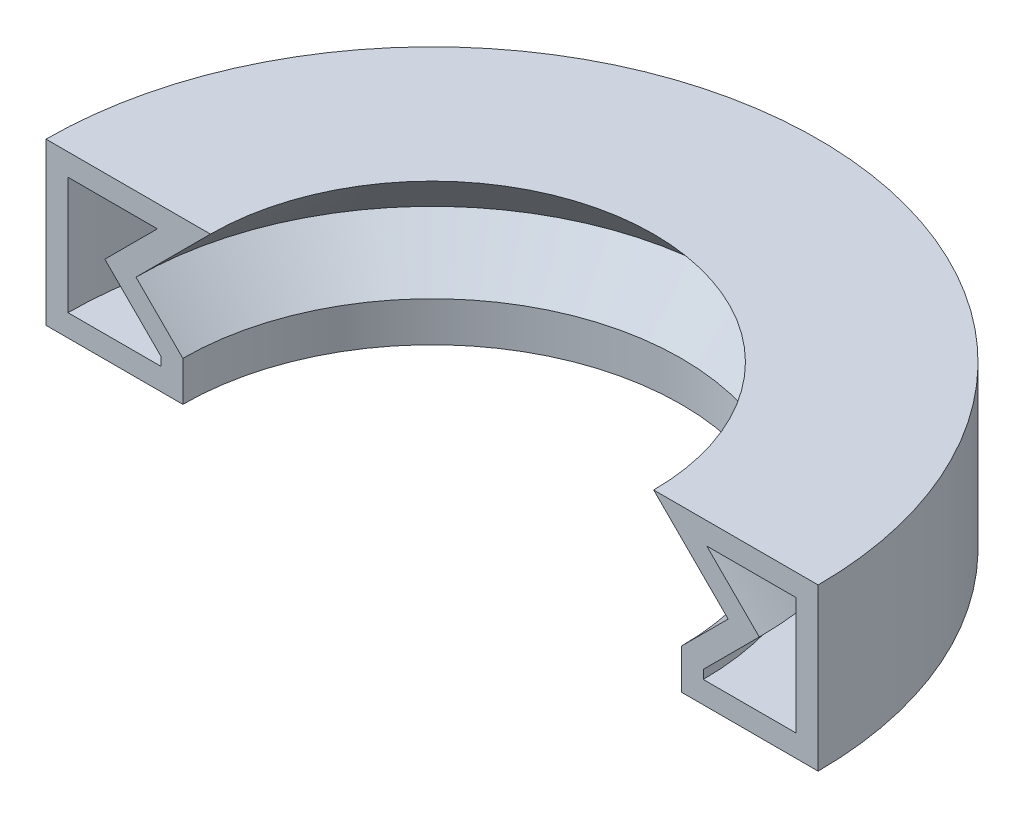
ISO-10303-21;
HEADER;
FILE_DESCRIPTION(('STEP AP214'),'2;1');
FILE_NAME('part.step','',(''),(''),'','','');
FILE_SCHEMA(('AUTOMOTIVE_DESIGN { 1 0 10303 214 1 1 1 1 }'));
ENDSEC;
DATA;
#1=APPLICATION_CONTEXT('core data for automotive mechanical design processes');
#2=APPLICATION_PROTOCOL_DEFINITION('international standard','automotive_design',2000,#1);
#3=PRODUCT_CONTEXT('',#1,'mechanical');
#4=PRODUCT('Part','Part','',(#3));
#5=PRODUCT_RELATED_PRODUCT_CATEGORY('part','',(#4));
#6=PRODUCT_DEFINITION_FORMATION('','',#4);
#7=PRODUCT_DEFINITION_CONTEXT('part definition',#1,'design');
#8=PRODUCT_DEFINITION('design','',#6,#7);
#9=PRODUCT_DEFINITION_SHAPE('','',#8);
#10=(LENGTH_UNIT() NAMED_UNIT(*) SI_UNIT(.MILLI.,.METRE.));
#11=(NAMED_UNIT(*) PLANE_ANGLE_UNIT() SI_UNIT($,.RADIAN.));
#12=(NAMED_UNIT(*) SI_UNIT($,.STERADIAN.) SOLID_ANGLE_UNIT());
#13=UNCERTAINTY_MEASURE_WITH_UNIT(LENGTH_MEASURE(1.E-05),#10,'distance_accuracy_value','');
#14=(GEOMETRIC_REPRESENTATION_CONTEXT(3) GLOBAL_UNCERTAINTY_ASSIGNED_CONTEXT((#13)) GLOBAL_UNIT_ASSIGNED_CONTEXT((#10,
#11,#12)) REPRESENTATION_CONTEXT('',''));
#15=CARTESIAN_POINT('',(0.,0.,0.));
#16=DIRECTION('',(0.,0.,1.));
#17=DIRECTION('',(1.,0.,0.));
#18=AXIS2_PLACEMENT_3D('',#15,#16,#17);
#19=CARTESIAN_POINT('',(-110.,-8.,7.68125894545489E-13));
#20=DIRECTION('',(0.,-1.,0.));
#21=DIRECTION('',(0.,0.,-1.));
#22=AXIS2_PLACEMENT_3D('',#19,#20,#21);
#23=PLANE('',#22);
#24=CARTESIAN_POINT('',(0.,-8.,0.));
#25=DIRECTION('',(0.,-1.,0.));
#26=DIRECTION('',(0.,0.,-1.));
#27=AXIS2_PLACEMENT_3D('',#24,#25,#26);
#28=CIRCLE('',#27,158.);
#29=CARTESIAN_POINT('',(-158.,-8.,1.10330810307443E-12));
#30=VERTEX_POINT('',#29);
#31=CARTESIAN_POINT('',(158.,-8.,0.));
#32=VERTEX_POINT('',#31);
#33=EDGE_CURVE('E11',#30,#32,#28,.T.);
#34=ORIENTED_EDGE('',*,*,#33,.T.);
#35=DIRECTION('',(1.,0.,0.));
#36=VECTOR('',#35,1.);
#37=CARTESIAN_POINT('',(110.,-8.,0.));
#38=LINE('',#37,#36);
#39=CARTESIAN_POINT('',(102.,-8.,0.));
#40=VERTEX_POINT('',#39);
#41=EDGE_CURVE('E128',#40,#32,#38,.T.);
#42=ORIENTED_EDGE('',*,*,#41,.F.);
#43=CARTESIAN_POINT('',(0.,-8.,0.));
#44=DIRECTION('',(0.,-1.,0.));
#45=DIRECTION('',(0.,0.,-1.));
#46=AXIS2_PLACEMENT_3D('',#43,#44,#45);
#47=CIRCLE('',#46,102.);
#48=CARTESIAN_POINT('',(-102.,-8.,7.12262193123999E-13));
#49=VERTEX_POINT('',#48);
#50=EDGE_CURVE('E210',#49,#40,#47,.T.);
#51=ORIENTED_EDGE('',*,*,#50,.F.);
#52=DIRECTION('',(-1.,0.,0.));
#53=VECTOR('',#52,1.);
#54=CARTESIAN_POINT('',(-110.,-8.,7.68125894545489E-13));
#55=LINE('',#54,#53);
#56=EDGE_CURVE('E192',#49,#30,#55,.T.);
#57=ORIENTED_EDGE('',*,*,#56,.T.);
#58=EDGE_LOOP('',(#34,#42,#51,#57));
#59=FACE_BOUND('',#58,.T.);
#60=ADVANCED_FACE('F32',(#59),#23,.T.);
#61=CARTESIAN_POINT('',(0.,0.,0.));
#62=DIRECTION('',(0.,-1.,0.));
#63=DIRECTION('',(0.,0.,-1.));
#64=AXIS2_PLACEMENT_3D('',#61,#62,#63);
#65=CYLINDRICAL_SURFACE('',#64,158.);
#66=CARTESIAN_POINT('',(0.,58.,0.));
#67=DIRECTION('',(0.,-1.,0.));
#68=DIRECTION('',(0.,0.,-1.));
#69=AXIS2_PLACEMENT_3D('',#66,#67,#68);
#70=CIRCLE('',#69,158.);
#71=CARTESIAN_POINT('',(-158.,58.,1.10330810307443E-12));
#72=VERTEX_POINT('',#71);
#73=CARTESIAN_POINT('',(158.,58.,0.));
#74=VERTEX_POINT('',#73);
#75=EDGE_CURVE('E40',#72,#74,#70,.T.);
#76=ORIENTED_EDGE('',*,*,#75,.T.);
#77=DIRECTION('',(0.,1.,0.));
#78=VECTOR('',#77,1.);
#79=CARTESIAN_POINT('',(158.,0.,0.));
#80=LINE('',#79,#78);
#81=EDGE_CURVE('E177',#32,#74,#80,.T.);
#82=ORIENTED_EDGE('',*,*,#81,.F.);
#83=ORIENTED_EDGE('',*,*,#33,.F.);
#84=DIRECTION('',(0.,1.,0.));
#85=VECTOR('',#84,1.);
#86=CARTESIAN_POINT('',(-158.,0.,1.10330810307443E-12));
#87=LINE('',#86,#85);
#88=EDGE_CURVE('E195',#30,#72,#87,.T.);
#89=ORIENTED_EDGE('',*,*,#88,.T.);
#90=EDGE_LOOP('',(#76,#82,#83,#89));
#91=FACE_BOUND('',#90,.T.);
#92=ADVANCED_FACE('F34',(#91),#65,.T.);
#93=CARTESIAN_POINT('',(-150.,58.,1.04744440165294E-12));
#94=DIRECTION('',(0.,1.,0.));
#95=DIRECTION('',(0.,0.,1.));
#96=AXIS2_PLACEMENT_3D('',#93,#94,#95);
#97=PLANE('',#96);
#98=CARTESIAN_POINT('',(0.,58.,0.));
#99=DIRECTION('',(0.,-1.,0.));
#100=DIRECTION('',(0.,0.,-1.));
#101=AXIS2_PLACEMENT_3D('',#98,#99,#100);
#102=CIRCLE('',#101,90.6862915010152);
#103=CARTESIAN_POINT('',(-90.6862915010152,58.,6.33258988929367E-13));
#104=VERTEX_POINT('',#103);
#105=CARTESIAN_POINT('',(90.6862915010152,58.,0.));
#106=VERTEX_POINT('',#105);
#107=EDGE_CURVE('E216',#104,#106,#102,.T.);
#108=ORIENTED_EDGE('',*,*,#107,.T.);
#109=DIRECTION('',(-1.,0.,0.));
#110=VECTOR('',#109,1.);
#111=CARTESIAN_POINT('',(150.,58.,0.));
#112=LINE('',#111,#110);
#113=EDGE_CURVE('E180',#74,#106,#112,.T.);
#114=ORIENTED_EDGE('',*,*,#113,.F.);
#115=ORIENTED_EDGE('',*,*,#75,.F.);
#116=DIRECTION('',(1.,0.,0.));
#117=VECTOR('',#116,1.);
#118=CARTESIAN_POINT('',(-150.,58.,1.04744440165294E-12));
#119=LINE('',#118,#117);
#120=EDGE_CURVE('E198',#72,#104,#119,.T.);
#121=ORIENTED_EDGE('',*,*,#120,.T.);
#122=EDGE_LOOP('',(#108,#114,#115,#121));
#123=FACE_BOUND('',#122,.T.);
#124=ADVANCED_FACE('F225',(#123),#97,.T.);
#125=CARTESIAN_POINT('',(0.,58.,0.));
#126=DIRECTION('',(0.,-1.,0.));
#127=DIRECTION('',(0.,0.,-1.));
#128=AXIS2_PLACEMENT_3D('',#125,#126,#127);
#129=CONICAL_SURFACE('',#128,90.6862915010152,0.785398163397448);
#130=CARTESIAN_POINT('',(0.,27.5,0.));
#131=DIRECTION('',(0.,-1.,0.));
#132=DIRECTION('',(0.,0.,-1.));
#133=AXIS2_PLACEMENT_3D('',#130,#131,#132);
#134=CIRCLE('',#133,121.186291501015);
#135=CARTESIAN_POINT('',(-121.186291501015,27.5,8.46239350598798E-13));
#136=VERTEX_POINT('',#135);
#137=CARTESIAN_POINT('',(121.186291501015,27.5,0.));
#138=VERTEX_POINT('',#137);
#139=EDGE_CURVE('E214',#136,#138,#134,.T.);
#140=ORIENTED_EDGE('',*,*,#139,.T.);
#141=DIRECTION('',(0.707106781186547,-0.707106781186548,0.));
#142=VECTOR('',#141,1.);
#143=CARTESIAN_POINT('',(104.343145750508,44.3431457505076,0.));
#144=LINE('',#143,#142);
#145=EDGE_CURVE('E183',#106,#138,#144,.T.);
#146=ORIENTED_EDGE('',*,*,#145,.F.);
#147=ORIENTED_EDGE('',*,*,#107,.F.);
#148=DIRECTION('',(-0.707106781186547,-0.707106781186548,0.));
#149=VECTOR('',#148,1.);
#150=CARTESIAN_POINT('',(-104.343145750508,44.3431457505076,7.28624292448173E-13));
#151=LINE('',#150,#149);
#152=EDGE_CURVE('E201',#104,#136,#151,.T.);
#153=ORIENTED_EDGE('',*,*,#152,.T.);
#154=EDGE_LOOP('',(#140,#146,#147,#153));
#155=FACE_BOUND('',#154,.T.);
#156=ADVANCED_FACE('F228',(#155),#129,.F.);
#157=CARTESIAN_POINT('',(0.,27.5,0.));
#158=DIRECTION('',(0.,1.,0.));
#159=DIRECTION('',(0.,0.,1.));
#160=AXIS2_PLACEMENT_3D('',#157,#158,#159);
#161=CONICAL_SURFACE('',#160,121.186291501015,0.785398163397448);
#162=CARTESIAN_POINT('',(0.,8.31370849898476,0.));
#163=DIRECTION('',(0.,-1.,0.));
#164=DIRECTION('',(0.,0.,-1.));
#165=AXIS2_PLACEMENT_3D('',#162,#163,#164);
#166=CIRCLE('',#165,102.);
#167=CARTESIAN_POINT('',(-102.,8.31370849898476,7.12262193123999E-13));
#168=VERTEX_POINT('',#167);
#169=CARTESIAN_POINT('',(102.,8.31370849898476,0.));
#170=VERTEX_POINT('',#169);
#171=EDGE_CURVE('E212',#168,#170,#166,.T.);
#172=ORIENTED_EDGE('',*,*,#171,.T.);
#173=DIRECTION('',(-0.707106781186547,-0.707106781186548,0.));
#174=VECTOR('',#173,1.);
#175=CARTESIAN_POINT('',(126.843145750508,33.1568542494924,0.));
#176=LINE('',#175,#174);
#177=EDGE_CURVE('E186',#138,#170,#176,.T.);
#178=ORIENTED_EDGE('',*,*,#177,.F.);
#179=ORIENTED_EDGE('',*,*,#139,.F.);
#180=DIRECTION('',(0.707106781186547,-0.707106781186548,0.));
#181=VECTOR('',#180,1.);
#182=CARTESIAN_POINT('',(-126.843145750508,33.1568542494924,8.85740952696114E-13));
#183=LINE('',#182,#181);
#184=EDGE_CURVE('E204',#136,#168,#183,.T.);
#185=ORIENTED_EDGE('',*,*,#184,.T.);
#186=EDGE_LOOP('',(#172,#178,#179,#185));
#187=FACE_BOUND('',#186,.T.);
#188=ADVANCED_FACE('F233',(#187),#161,.F.);
#189=CARTESIAN_POINT('',(0.,0.,0.));
#190=DIRECTION('',(0.,-1.,0.));
#191=DIRECTION('',(0.,0.,-1.));
#192=AXIS2_PLACEMENT_3D('',#189,#190,#191);
#193=CYLINDRICAL_SURFACE('',#192,102.);
#194=DIRECTION('',(0.,-1.,0.));
#195=VECTOR('',#194,1.);
#196=CARTESIAN_POINT('',(-102.,5.,7.12262193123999E-13));
#197=LINE('',#196,#195);
#198=EDGE_CURVE('E207',#168,#49,#197,.T.);
#199=ORIENTED_EDGE('',*,*,#198,.T.);
#200=ORIENTED_EDGE('',*,*,#50,.T.);
#201=DIRECTION('',(0.,-1.,0.));
#202=VECTOR('',#201,1.);
#203=CARTESIAN_POINT('',(102.,5.,0.));
#204=LINE('',#203,#202);
#205=EDGE_CURVE('E189',#170,#40,#204,.T.);
#206=ORIENTED_EDGE('',*,*,#205,.F.);
#207=ORIENTED_EDGE('',*,*,#171,.F.);
#208=EDGE_LOOP('',(#199,#200,#206,#207));
#209=FACE_BOUND('',#208,.T.);
#210=ADVANCED_FACE('F236',(#209),#193,.F.);
#211=CARTESIAN_POINT('',(0.,0.,0.));
#212=DIRECTION('',(0.,0.,-1.));
#213=DIRECTION('',(-1.,0.,0.));
#214=AXIS2_PLACEMENT_3D('',#211,#212,#213);
#215=PLANE('',#214);
#216=DIRECTION('',(0.,-1.,0.));
#217=VECTOR('',#216,1.);
#218=CARTESIAN_POINT('',(-111.,5.,7.75108857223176E-13));
#219=LINE('',#218,#217);
#220=CARTESIAN_POINT('',(-111.,4.5857864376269,7.75108857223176E-13));
#221=VERTEX_POINT('',#220);
#222=CARTESIAN_POINT('',(-111.,1.,7.75108857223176E-13));
#223=VERTEX_POINT('',#222);
#224=EDGE_CURVE('E164',#221,#223,#219,.T.);
#225=ORIENTED_EDGE('',*,*,#224,.T.);
#226=DIRECTION('',(-1.,0.,0.));
#227=VECTOR('',#226,1.);
#228=CARTESIAN_POINT('',(-110.,1.,7.68125894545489E-13));
#229=LINE('',#228,#227);
#230=CARTESIAN_POINT('',(-149.,1.,1.04046143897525E-12));
#231=VERTEX_POINT('',#230);
#232=EDGE_CURVE('E47',#223,#231,#229,.T.);
#233=ORIENTED_EDGE('',*,*,#232,.T.);
#234=DIRECTION('',(0.,1.,0.));
#235=VECTOR('',#234,1.);
#236=CARTESIAN_POINT('',(-149.,0.,1.04046143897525E-12));
#237=LINE('',#236,#235);
#238=CARTESIAN_POINT('',(-149.,49.,1.04046143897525E-12));
#239=VERTEX_POINT('',#238);
#240=EDGE_CURVE('E127',#231,#239,#237,.T.);
#241=ORIENTED_EDGE('',*,*,#240,.T.);
#242=DIRECTION('',(1.,0.,0.));
#243=VECTOR('',#242,1.);
#244=CARTESIAN_POINT('',(-150.,49.,1.04744440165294E-12));
#245=LINE('',#244,#243);
#246=CARTESIAN_POINT('',(-112.414213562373,49.,7.84984257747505E-13));
#247=VERTEX_POINT('',#246);
#248=EDGE_CURVE('E155',#239,#247,#245,.T.);
#249=ORIENTED_EDGE('',*,*,#248,.T.);
#250=DIRECTION('',(-0.707106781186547,-0.707106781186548,0.));
#251=VECTOR('',#250,1.);
#252=CARTESIAN_POINT('',(-110.707106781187,50.7071067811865,7.73063594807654E-13));
#253=LINE('',#252,#251);
#254=CARTESIAN_POINT('',(-133.914213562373,27.5,9.35117955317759E-13));
#255=VERTEX_POINT('',#254);
#256=EDGE_CURVE('E158',#247,#255,#253,.T.);
#257=ORIENTED_EDGE('',*,*,#256,.T.);
#258=DIRECTION('',(0.707106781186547,-0.707106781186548,0.));
#259=VECTOR('',#258,1.);
#260=CARTESIAN_POINT('',(-133.207106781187,26.7928932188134,9.30180255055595E-13));
#261=LINE('',#260,#259);
#262=EDGE_CURVE('E161',#255,#221,#261,.T.);
#263=ORIENTED_EDGE('',*,*,#262,.T.);
#264=EDGE_LOOP('',(#225,#233,#241,#249,#257,#263));
#265=FACE_BOUND('',#264,.T.);
#266=ORIENTED_EDGE('',*,*,#56,.F.);
#267=ORIENTED_EDGE('',*,*,#198,.F.);
#268=ORIENTED_EDGE('',*,*,#184,.F.);
#269=ORIENTED_EDGE('',*,*,#152,.F.);
#270=ORIENTED_EDGE('',*,*,#120,.F.);
#271=ORIENTED_EDGE('',*,*,#88,.F.);
#272=EDGE_LOOP('',(#266,#267,#268,#269,#270,#271));
#273=FACE_BOUND('',#272,.T.);
#274=ADVANCED_FACE('F240',(#265,#273),#215,.F.);
#275=CARTESIAN_POINT('',(0.,0.,0.));
#276=DIRECTION('',(0.,0.,1.));
#277=DIRECTION('',(1.,0.,0.));
#278=AXIS2_PLACEMENT_3D('',#275,#276,#277);
#279=PLANE('',#278);
#280=DIRECTION('',(1.,0.,0.));
#281=VECTOR('',#280,1.);
#282=CARTESIAN_POINT('',(110.,1.,0.));
#283=LINE('',#282,#281);
#284=CARTESIAN_POINT('',(111.,1.,0.));
#285=VERTEX_POINT('',#284);
#286=CARTESIAN_POINT('',(149.,1.,0.));
#287=VERTEX_POINT('',#286);
#288=EDGE_CURVE('E132',#285,#287,#283,.T.);
#289=ORIENTED_EDGE('',*,*,#288,.F.);
#290=DIRECTION('',(0.,-1.,0.));
#291=VECTOR('',#290,1.);
#292=CARTESIAN_POINT('',(111.,5.,0.));
#293=LINE('',#292,#291);
#294=CARTESIAN_POINT('',(111.,4.5857864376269,0.));
#295=VERTEX_POINT('',#294);
#296=EDGE_CURVE('E151',#295,#285,#293,.T.);
#297=ORIENTED_EDGE('',*,*,#296,.F.);
#298=DIRECTION('',(-0.707106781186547,-0.707106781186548,0.));
#299=VECTOR('',#298,1.);
#300=CARTESIAN_POINT('',(133.207106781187,26.7928932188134,0.));
#301=LINE('',#300,#299);
#302=CARTESIAN_POINT('',(133.914213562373,27.5,0.));
#303=VERTEX_POINT('',#302);
#304=EDGE_CURVE('E55',#303,#295,#301,.T.);
#305=ORIENTED_EDGE('',*,*,#304,.F.);
#306=DIRECTION('',(0.707106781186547,-0.707106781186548,0.));
#307=VECTOR('',#306,1.);
#308=CARTESIAN_POINT('',(110.707106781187,50.7071067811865,0.));
#309=LINE('',#308,#307);
#310=CARTESIAN_POINT('',(112.414213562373,49.,0.));
#311=VERTEX_POINT('',#310);
#312=EDGE_CURVE('E145',#311,#303,#309,.T.);
#313=ORIENTED_EDGE('',*,*,#312,.F.);
#314=DIRECTION('',(-1.,0.,0.));
#315=VECTOR('',#314,1.);
#316=CARTESIAN_POINT('',(150.,49.,0.));
#317=LINE('',#316,#315);
#318=CARTESIAN_POINT('',(149.,49.,0.));
#319=VERTEX_POINT('',#318);
#320=EDGE_CURVE('E143',#319,#311,#317,.T.);
#321=ORIENTED_EDGE('',*,*,#320,.F.);
#322=DIRECTION('',(0.,1.,0.));
#323=VECTOR('',#322,1.);
#324=CARTESIAN_POINT('',(149.,0.,0.));
#325=LINE('',#324,#323);
#326=EDGE_CURVE('E124',#287,#319,#325,.T.);
#327=ORIENTED_EDGE('',*,*,#326,.F.);
#328=EDGE_LOOP('',(#289,#297,#305,#313,#321,#327));
#329=FACE_BOUND('',#328,.T.);
#330=ORIENTED_EDGE('',*,*,#41,.T.);
#331=ORIENTED_EDGE('',*,*,#81,.T.);
#332=ORIENTED_EDGE('',*,*,#113,.T.);
#333=ORIENTED_EDGE('',*,*,#145,.T.);
#334=ORIENTED_EDGE('',*,*,#177,.T.);
#335=ORIENTED_EDGE('',*,*,#205,.T.);
#336=EDGE_LOOP('',(#330,#331,#332,#333,#334,#335));
#337=FACE_BOUND('',#336,.T.);
#338=ADVANCED_FACE('F139',(#329,#337),#279,.T.);
#339=CARTESIAN_POINT('',(-110.,1.,7.68125894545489E-13));
#340=DIRECTION('',(0.,-1.,0.));
#341=DIRECTION('',(0.,0.,-1.));
#342=AXIS2_PLACEMENT_3D('',#339,#340,#341);
#343=PLANE('',#342);
#344=CARTESIAN_POINT('',(0.,1.,0.));
#345=DIRECTION('',(0.,-1.,0.));
#346=DIRECTION('',(0.,0.,-1.));
#347=AXIS2_PLACEMENT_3D('',#344,#345,#346);
#348=CIRCLE('',#347,149.);
#349=EDGE_CURVE('E120',#231,#287,#348,.T.);
#350=ORIENTED_EDGE('',*,*,#349,.F.);
#351=ORIENTED_EDGE('',*,*,#232,.F.);
#352=CARTESIAN_POINT('',(0.,1.,0.));
#353=DIRECTION('',(0.,-1.,0.));
#354=DIRECTION('',(0.,0.,-1.));
#355=AXIS2_PLACEMENT_3D('',#352,#353,#354);
#356=CIRCLE('',#355,111.);
#357=EDGE_CURVE('E134',#223,#285,#356,.T.);
#358=ORIENTED_EDGE('',*,*,#357,.T.);
#359=ORIENTED_EDGE('',*,*,#288,.T.);
#360=EDGE_LOOP('',(#350,#351,#358,#359));
#361=FACE_BOUND('',#360,.T.);
#362=ADVANCED_FACE('F133',(#361),#343,.F.);
#363=CARTESIAN_POINT('',(0.,0.,0.));
#364=DIRECTION('',(0.,-1.,0.));
#365=DIRECTION('',(0.,0.,-1.));
#366=AXIS2_PLACEMENT_3D('',#363,#364,#365);
#367=CYLINDRICAL_SURFACE('',#366,149.);
#368=CARTESIAN_POINT('',(0.,49.,0.));
#369=DIRECTION('',(0.,-1.,0.));
#370=DIRECTION('',(0.,0.,-1.));
#371=AXIS2_PLACEMENT_3D('',#368,#369,#370);
#372=CIRCLE('',#371,149.);
#373=EDGE_CURVE('E129',#239,#319,#372,.T.);
#374=ORIENTED_EDGE('',*,*,#373,.F.);
#375=ORIENTED_EDGE('',*,*,#240,.F.);
#376=ORIENTED_EDGE('',*,*,#349,.T.);
#377=ORIENTED_EDGE('',*,*,#326,.T.);
#378=EDGE_LOOP('',(#374,#375,#376,#377));
#379=FACE_BOUND('',#378,.T.);
#380=ADVANCED_FACE('F122',(#379),#367,.F.);
#381=CARTESIAN_POINT('',(-150.,49.,1.04744440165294E-12));
#382=DIRECTION('',(0.,1.,0.));
#383=DIRECTION('',(0.,0.,1.));
#384=AXIS2_PLACEMENT_3D('',#381,#382,#383);
#385=PLANE('',#384);
#386=CARTESIAN_POINT('',(0.,49.,0.));
#387=DIRECTION('',(0.,-1.,0.));
#388=DIRECTION('',(0.,0.,-1.));
#389=AXIS2_PLACEMENT_3D('',#386,#387,#388);
#390=CIRCLE('',#389,112.414213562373);
#391=EDGE_CURVE('E172',#247,#311,#390,.T.);
#392=ORIENTED_EDGE('',*,*,#391,.F.);
#393=ORIENTED_EDGE('',*,*,#248,.F.);
#394=ORIENTED_EDGE('',*,*,#373,.T.);
#395=ORIENTED_EDGE('',*,*,#320,.T.);
#396=EDGE_LOOP('',(#392,#393,#394,#395));
#397=FACE_BOUND('',#396,.T.);
#398=ADVANCED_FACE('F303',(#397),#385,.F.);
#399=CARTESIAN_POINT('',(0.,49.,0.));
#400=DIRECTION('',(0.,-1.,0.));
#401=DIRECTION('',(0.,0.,-1.));
#402=AXIS2_PLACEMENT_3D('',#399,#400,#401);
#403=CONICAL_SURFACE('',#402,112.414213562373,0.785398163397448);
#404=CARTESIAN_POINT('',(0.,27.5,0.));
#405=DIRECTION('',(0.,-1.,0.));
#406=DIRECTION('',(0.,0.,-1.));
#407=AXIS2_PLACEMENT_3D('',#404,#405,#406);
#408=CIRCLE('',#407,133.914213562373);
#409=EDGE_CURVE('E170',#255,#303,#408,.T.);
#410=ORIENTED_EDGE('',*,*,#409,.F.);
#411=ORIENTED_EDGE('',*,*,#256,.F.);
#412=ORIENTED_EDGE('',*,*,#391,.T.);
#413=ORIENTED_EDGE('',*,*,#312,.T.);
#414=EDGE_LOOP('',(#410,#411,#412,#413));
#415=FACE_BOUND('',#414,.T.);
#416=ADVANCED_FACE('F312',(#415),#403,.T.);
#417=CARTESIAN_POINT('',(0.,27.5,0.));
#418=DIRECTION('',(0.,1.,0.));
#419=DIRECTION('',(0.,0.,1.));
#420=AXIS2_PLACEMENT_3D('',#417,#418,#419);
#421=CONICAL_SURFACE('',#420,133.914213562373,0.785398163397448);
#422=CARTESIAN_POINT('',(0.,4.5857864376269,0.));
#423=DIRECTION('',(0.,-1.,0.));
#424=DIRECTION('',(0.,0.,-1.));
#425=AXIS2_PLACEMENT_3D('',#422,#423,#424);
#426=CIRCLE('',#425,111.);
#427=EDGE_CURVE('E168',#221,#295,#426,.T.);
#428=ORIENTED_EDGE('',*,*,#427,.F.);
#429=ORIENTED_EDGE('',*,*,#262,.F.);
#430=ORIENTED_EDGE('',*,*,#409,.T.);
#431=ORIENTED_EDGE('',*,*,#304,.T.);
#432=EDGE_LOOP('',(#428,#429,#430,#431));
#433=FACE_BOUND('',#432,.T.);
#434=ADVANCED_FACE('F322',(#433),#421,.T.);
#435=CARTESIAN_POINT('',(0.,0.,0.));
#436=DIRECTION('',(0.,-1.,0.));
#437=DIRECTION('',(0.,0.,-1.));
#438=AXIS2_PLACEMENT_3D('',#435,#436,#437);
#439=CYLINDRICAL_SURFACE('',#438,111.);
#440=ORIENTED_EDGE('',*,*,#224,.F.);
#441=ORIENTED_EDGE('',*,*,#427,.T.);
#442=ORIENTED_EDGE('',*,*,#296,.T.);
#443=ORIENTED_EDGE('',*,*,#357,.F.);
#444=EDGE_LOOP('',(#440,#441,#442,#443));
#445=FACE_BOUND('',#444,.T.);
#446=ADVANCED_FACE('F332',(#445),#439,.T.);
#447=CLOSED_SHELL('',(#60,#92,#124,#156,#188,#210,#274,#338,#362,#380,#398,#416,#434,#446));
#448=MANIFOLD_SOLID_BREP('B2',#447);
#449=ADVANCED_BREP_SHAPE_REPRESENTATION('',(#18,#448),#14);
#450=SHAPE_DEFINITION_REPRESENTATION(#9,#449);
ENDSEC;
END-ISO-10303-21;
